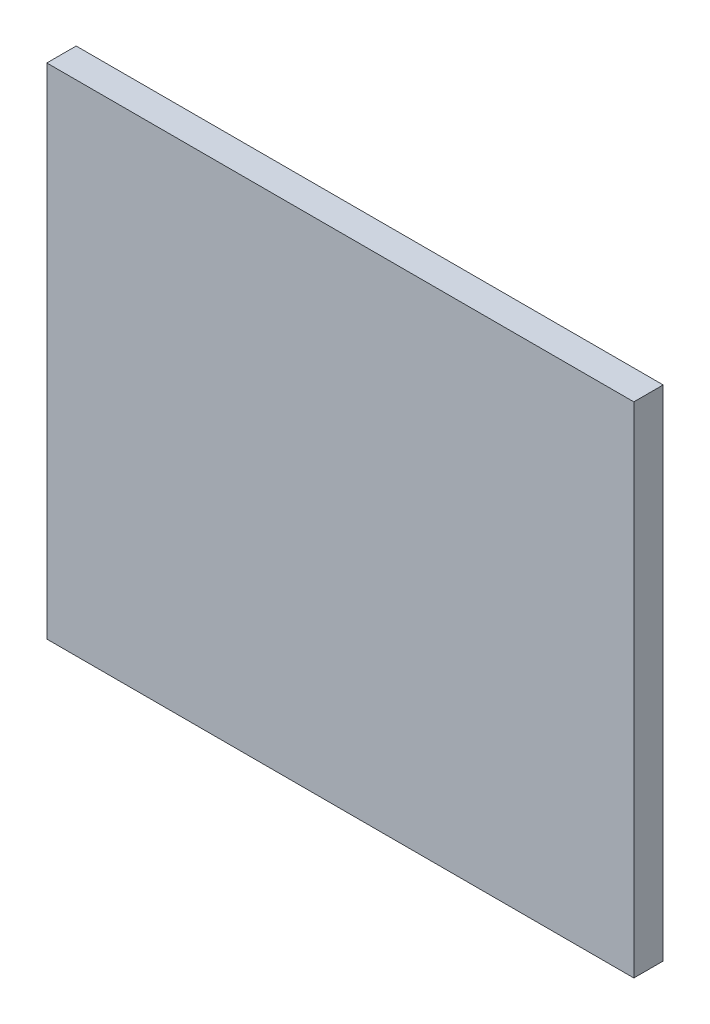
from build123d import *

# Parameters (mm, degrees)
SKETCH1_W           = 2
SKETCH1_H           = 1.7
BOSS_EXTRUDE1_DEPTH = 0.1


with BuildPart() as part:
    # Sketch1 → Boss-Extrude1 (new body)
    with BuildSketch(Plane.XY):
        Rectangle(SKETCH1_W, SKETCH1_H)
    extrude(amount=BOSS_EXTRUDE1_DEPTH)


solid = part.part
